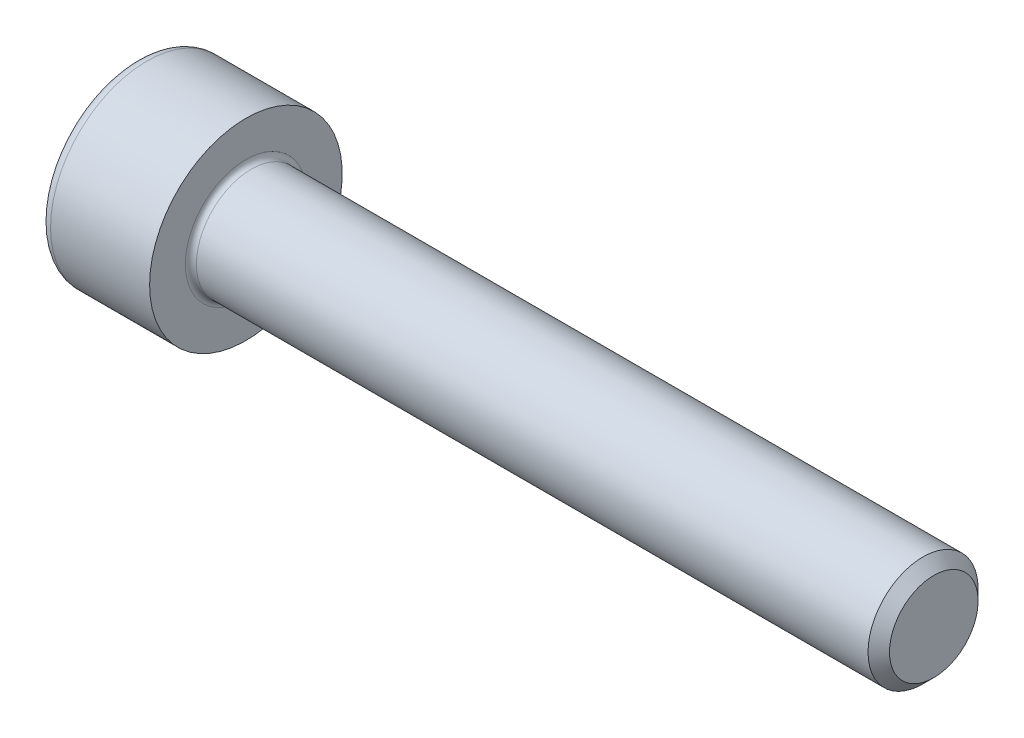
from build123d import *

# Parameters (mm, degrees)
FILLET1_R   = 0.2
FILLET2_R   = 0.4
HEX_2_DEPTH = 2


with BuildPart() as part:
    # BodySke → Base-Revolve (revolve)
    with BuildSketch(Plane.XY, mode=Mode.PRIVATE) as base_revolve_sk:
        Polygon((0, 0), (0, 3.5), (4, 3.5), (4, 2), (28.61, 2), (29, 1.61), (29, 0), align=None)
    revolve(base_revolve_sk.sketch.rotate(Axis((-31.75, 0, 0), (1, 0, 0)), 90), axis=Axis((-31.75, 0, 0), (1, 0, 0)))

    # Fillet1
    fillet1_edges = [part.edges().sort_by_distance(p)[0] for p in [
        (4, 0, -2),
    ]]
    fillet(fillet1_edges, radius=FILLET1_R)

    # Fillet2
    fillet2_edges = [part.edges().sort_by_distance(p)[0] for p in [
        (0, 0, -3.5),
    ]]
    fillet(fillet2_edges, radius=FILLET2_R)

    # Sketch2 → Hex-PreBroach (revolve, cut)
    with BuildSketch(Plane.XY, mode=Mode.PRIVATE) as hex_prebroach_sk:
        Polygon((0, 1.51), (2, 1.51), (2.871798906, 0), (0, 0), align=None)
    revolve(hex_prebroach_sk.sketch.rotate(Axis((0, 0, 0), (1, 0, 0)), 90), axis=Axis((0, 0, 0), (1, 0, 0)), mode=Mode.SUBTRACT)

    # Sketch3 → Hex 2 (cut)
    with BuildSketch(Plane(origin=(0, 0, 0), x_dir=(0, 0.500000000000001, 0.866025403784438), z_dir=(-1, 0, 0))):
        Polygon((0.871798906, 1.51), (-0.871798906, 1.51), (-1.743597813, 0), (-0.871798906, -1.51), (0.871798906, -1.51), (1.743597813, 0), align=None)
    extrude(amount=-HEX_2_DEPTH, mode=Mode.SUBTRACT)


solid = part.part
